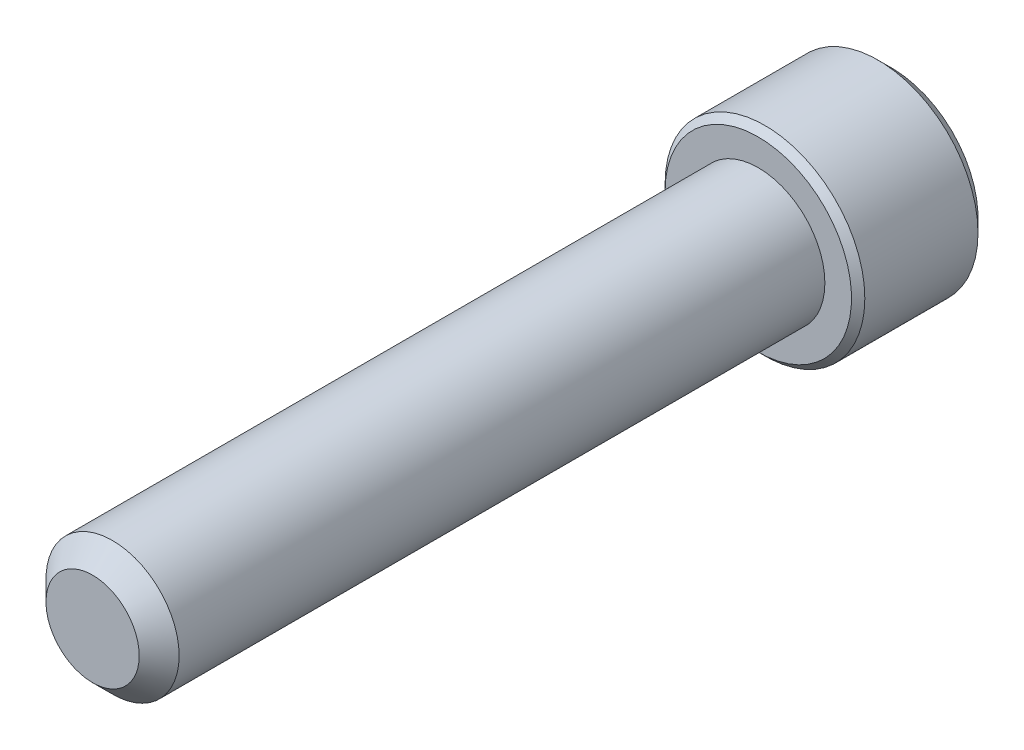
from build123d import *

# Parameters (mm, degrees)
SKETCH1_R          = 3.175
EXTRUDE1_DEPTH     = 31.75
CHAMFER3_SIZE      = 0.9525
SKETCH6_R          = 4.7625
EXTRUDE2_DEPTH     = 6.35
CUT_EXTRUDE1_DEPTH = 3.571875
SKETCH8_R          = 2.749630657
CUT_EXTRUDE2_DEPTH = 0.635
CUT_EXTRUDE2_DRAFT = -45
CHAMFER1_SIZE      = 0.635
CHAMFER2_SIZE      = 0.3175


with BuildPart() as part:
    # Sketch1 → Extrude1 (new body)
    with BuildSketch(Plane.XY):
        Circle(SKETCH1_R)
    extrude(amount=-EXTRUDE1_DEPTH)

    # Chamfer3
    chamfer3_edges = [part.edges().sort_by_distance(p)[0] for p in [
        (-3.175, 0, 0),
    ]]
    chamfer(chamfer3_edges, length=CHAMFER3_SIZE)

    # Sketch6 → Extrude2 (add)
    with BuildSketch(Plane(origin=(0, 0, -31.75), x_dir=(-1, 0, 0), z_dir=(0, 0, -1))):
        Circle(SKETCH6_R)
    extrude(amount=EXTRUDE2_DEPTH)

    # Sketch7 → Cut-Extrude1 (cut)
    with BuildSketch(Plane(origin=(0, 0, -38.1), x_dir=(-1, 0, 0), z_dir=(0, 0, -1))):
        Polygon((0, 2.749630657), (-2.38125, 1.374815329), (-2.38125, -1.374815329), (0, -2.749630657), (2.38125, -1.374815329), (2.38125, 1.374815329), align=None)
    extrude(amount=-CUT_EXTRUDE1_DEPTH, mode=Mode.SUBTRACT)


with BuildPart() as cut_extrude2_tool:
    # Sketch8 → Cut-Extrude2 (with draft: the straight prism first)
    with BuildSketch(Plane(origin=(0, 0, -38.1), x_dir=(-1, 0, 0), z_dir=(0, 0, -1))):
        Circle(SKETCH8_R)
    extrude(amount=-CUT_EXTRUDE2_DEPTH)
    # Cut-Extrude2: the draft: its side faces are tilted about the plane it starts from
    cut_extrude2_sides = [cut_extrude2_tool.faces().sort_by_distance(p)[0] for p in [
        (2.749630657, 0, -37.7825),
    ]]
    draft(cut_extrude2_sides, Plane(origin=(0, 0, -38.1), x_dir=(-1, 0, 0), z_dir=(0, 0, -1)), CUT_EXTRUDE2_DRAFT)


with BuildPart() as part_1:
    add(part.part)

    # Cut-Extrude2: cut by cut_extrude2_tool
    add(cut_extrude2_tool.part, mode=Mode.SUBTRACT)

    # Chamfer1
    chamfer1_edges = [part_1.edges().sort_by_distance(p)[0] for p in [
        (4.7625, 0, -38.1),
    ]]
    chamfer(chamfer1_edges, length=CHAMFER1_SIZE)

    # Chamfer2
    chamfer2_edges = [part_1.edges().sort_by_distance(p)[0] for p in [
        (4.7625, 0, -31.75),
    ]]
    chamfer(chamfer2_edges, length=CHAMFER2_SIZE)


solid = part_1.part
